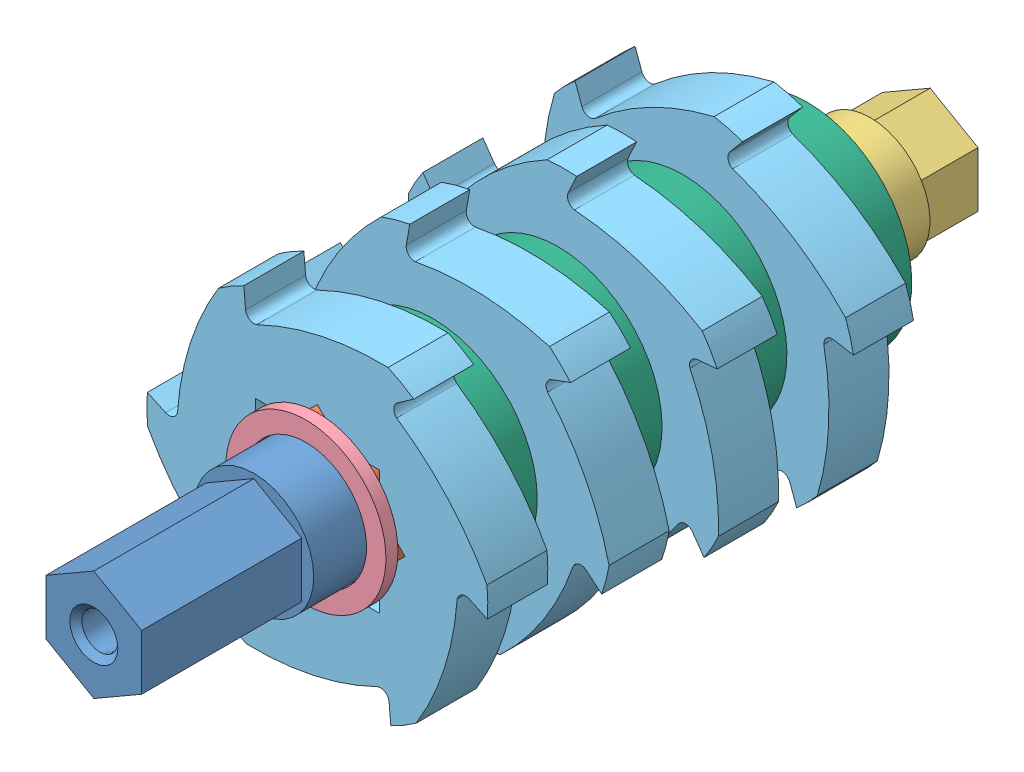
SolidWorks assembly longer shaft assembly.SLDASM, configuration Default (file format 5000). Lengths in mm.
Overall size (115.09 115.11 209).
13 component instances, 6 part files, 28 mates.
Components (placement in the parent):
- for shaft long-2: for shaft long.SLDPRT [Default] at (-15 15 -81) x (1 0 0) z (0 -1 0) size (29.9 81 29.9)
- square tube_iso-2: square tube_iso.sldprt [30 x 30 x 2.0x122] at (-30 0 -117) size (30 30 122)
- for shaft1-3: for shaft1.SLDPRT [Default] at (-15 15 -153) x (-1 0 0) z (0 -1 0) size (29.9 56 29.9)
- print st-6: print st.SLDPRT [Default] at (-15 15 -53) x (-0.313696 0.949523 0) z (-0.949523 -0.313696 0) size (40 3 40)
- print st-7: print st.SLDPRT [Default] at (-15 15 -178) x (-0.283519 0.958967 0) z (-0.958967 -0.283519 0) size (40 3 40)
- bioshredder 10-7: bioshredder 10.SLDPRT [15] at (-15.15 14.85 -69.95) x (0 -1 0) z (0 0 1) size (77.56 85.2 15)
- bioshredder 10-8: bioshredder 10.SLDPRT [15] at (-14.85 14.85 -100.55) x (0.707107 -0.707107 0) z (0 0 1) size (77.56 85.2 15)
- bioshredder 10-9: bioshredder 10.SLDPRT [15] at (-14.85 14.85 -131.15) size (77.56 85.2 15)
- bioshredder 10-10: bioshredder 10.SLDPRT [15] at (-14.85 14.8285 -161.75) x (0.707107 0.707107 0) z (0 0 1) size (77.56 85.2 15)
- bioshredder spacer 2-1: bioshredder spacer 2.SLDPRT [15,6] at (-15 15 -178.4) x (1 0 0) z (0 -1 0) size (52 15.6 52)
- bioshredder spacer 2-2: bioshredder spacer 2.SLDPRT [15,6] at (-15 15 -147.2) x (1 0 0) z (0 -1 0) size (52 15.6 52)
- bioshredder spacer 2-3: bioshredder spacer 2.SLDPRT [15,6] at (-15 15 -116) x (1 0 0) z (0 -1 0) size (52 15.6 52)
- bioshredder spacer 2-4: bioshredder spacer 2.SLDPRT [15,6] at (-15 15 -84.8) x (1 0 0) z (0 -1 0) size (52 15.6 52)
Mates (geometry in assembly coordinates):
- Coincident12: coincident aligned: plane of for shaft long-2 through (-5 5 -56) normal (0 0 1); plane of square tube_iso-2 through (-4 26 -56) normal (0 0 1)
- Coincident13: coincident anti-aligned: plane of for shaft long-2 through (-5 28 -56) normal (0 1 0); plane of square tube_iso-2 through (-4 28 -56) normal (0 -1 0)
- Coincident14: coincident anti-aligned: plane of for shaft long-2 through (-2 5 -56) normal (1 0 0); plane of square tube_iso-2 through (-2 26 -56) normal (-1 0 0)
- Coincident40: coincident anti-aligned: plane of square tube_iso-2 through (-28 4 -56) normal (1 0 0); plane of for shaft1-3 through (-28 5 -178) normal (-1 0 0)
- Coincident41: coincident anti-aligned: plane of square tube_iso-2 through (-4 28 -56) normal (0 -1 0); plane of for shaft1-3 through (-25 28 -178) normal (0 1 0)
- Coincident42: coincident anti-aligned: plane of square tube_iso-2 through (-4 26 -178) normal (0 0 -1); plane of for shaft1-3 through (-15 15 -178) normal (0 0 1)
- Coincident43: coincident anti-aligned: plane of square tube_iso-2 through (-4 26 -56) normal (0 0 1); plane of print st-6 through (-15 15 -56) normal (0 0 -1)
- Coincident44: coincident anti-aligned: plane of square tube_iso-2 through (-4 26 -178) normal (0 0 -1); plane of print st-7 through (-15 15 -178) normal (0 0 1)
- Concentric17: concentric anti-aligned: cylinder of for shaft long-2 through (-15 15 -40) axis (0 0 -1) radius 14.95; cylinder of print st-6 through (-15 15 -56) axis (0 0 1) radius 15.15
- Concentric18: concentric aligned: cylinder of for shaft1-3 through (-15 15 -194) axis (0 0 1) radius 14.95; cylinder of print st-7 through (-15 15 -181) axis (0 0 1) radius 15.15
- Distance1: distance = 0.3285 mm anti-aligned: plane of square tube_iso-2 through (-4 30 -56) normal (0 1 0); plane of bioshredder 10-10 through (-8.4297 30.3285 -147.8) normal (0 -1 0)
- Distance2: distance = 0.35 mm anti-aligned: plane of square tube_iso-2 through (-30 4 -56) normal (-1 0 0); plane of bioshredder 10-10 through (-30.35 21.2488 -147.8) normal (1 0 0)
- Coincident47: coincident anti-aligned: plane of print st-6 through (-15 15 -56) normal (0 0 -1); plane of bioshredder 10-7 through (0.7159 -16.9772 -56) normal (0 0 1)
- Coincident50: coincident aligned: plane of for shaft long-2 through (-15 15 0) normal (0 0 1); plane of assembly through (0 0 0) normal (0 0 1)
- Coincident51: coincident anti-aligned: plane of square tube_iso-2 through (-26 0 -56) normal (0 -1 0); plane of assembly through (0 0 0) normal (0 1 0)
- Coincident52: coincident aligned: plane of square tube_iso-2 through (0 26 -56) normal (1 0 0); plane of assembly through (0 0 0) normal (1 0 0)
- Distance3: distance = 0.35 mm anti-aligned: plane of square tube_iso-2 through (-30 4 -56) normal (-1 0 0); plane of bioshredder 10-9 through (-30.35 21.2703 -117.2) normal (1 0 0)
- Distance4: distance = 0.35 mm anti-aligned: plane of square tube_iso-2 through (-4 30 -56) normal (0 1 0); plane of bioshredder 10-9 through (-8.4297 30.35 -117.2) normal (0 -1 0)
- Distance5: distance = 0.35 mm anti-aligned: plane of square tube_iso-2 through (-4 30 -56) normal (0 1 0); plane of bioshredder 10-8 through (-8.4297 30.35 -86.6) normal (0 -1 0)
- Distance6: distance = 0.35 mm anti-aligned: plane of square tube_iso-2 through (-30 4 -56) normal (-1 0 0); plane of bioshredder 10-8 through (-30.35 30.35 -86.6) normal (1 0 0)
- Distance7: distance = 0.35 mm anti-aligned: plane of square tube_iso-2 through (-4 30 -56) normal (0 1 0); plane of bioshredder 10-7 through (-8.7297 30.35 -56) normal (0 -1 0)
- Distance8: distance = 0.35 mm anti-aligned: plane of square tube_iso-2 through (0 26 -56) normal (1 0 0); plane of bioshredder 10-7 through (0.35 8.4297 -56) normal (-1 0 0)
- Concentric19: concentric anti-aligned: cylinder of for shaft1-3 through (-15 15 -194) axis (0 0 1) radius 14.95; cylinder of bioshredder spacer 2-1 through (-15 15 -162.8) axis (0 0 -1) radius 26
- Distance9: distance = 15.6 mm anti-aligned: plane of bioshredder 10-9 through (16.9772 30.7159 -132.2) normal (0 0 -1); plane of bioshredder 10-10 through (-3.5636 48.5526 -147.8) normal (0 0 1)
- Distance10: distance = 15.6 mm anti-aligned: plane of bioshredder 10-9 through (16.9772 30.7159 -117.2) normal (0 0 1); plane of bioshredder 10-8 through (18.8741 3.5636 -101.6) normal (0 0 -1)
- Distance11: distance = 15.6 mm anti-aligned: plane of bioshredder 10-7 through (0.7159 -16.9772 -71) normal (0 0 -1); plane of bioshredder 10-8 through (18.8741 3.5636 -86.6) normal (0 0 1)
- Parallel1: parallel aligned: plane of bioshredder 10-10 through (-8.4297 30.3285 -147.8) normal (0 -1 0); plane of bioshredder spacer 2-1 through (-1.85 30.15 -162.8) normal (0 -1 0)
- Coincident57: coincident anti-aligned: plane of bioshredder 10-10 through (-3.5636 48.5526 -162.8) normal (0 0 -1); plane of bioshredder spacer 2-1 through (-15 15 -162.8) normal (0 0 1)
